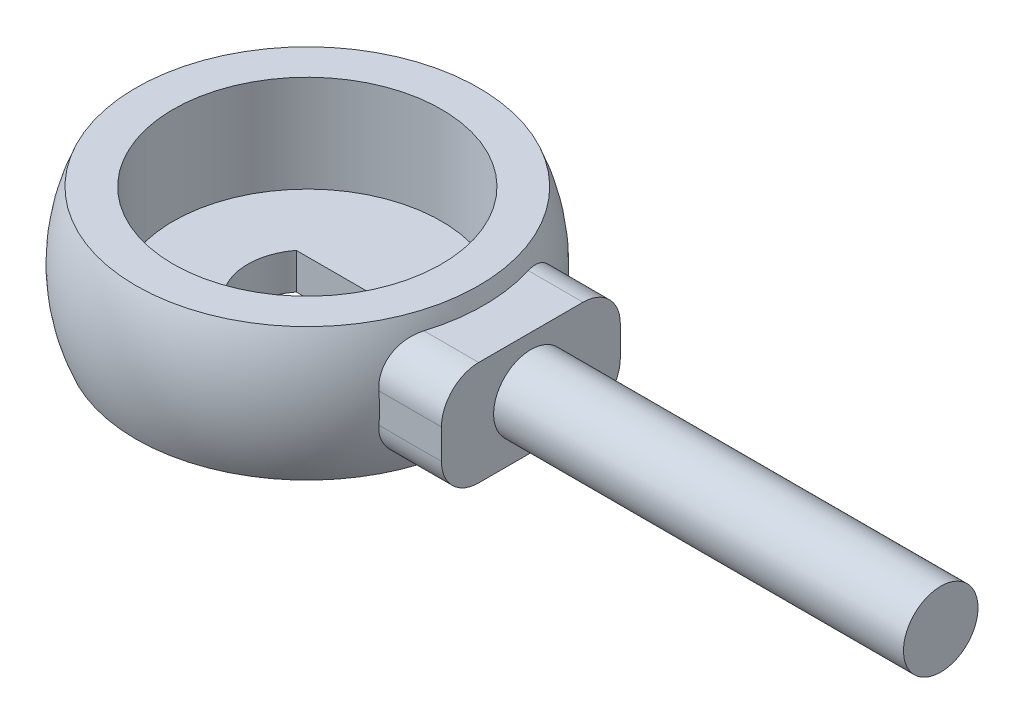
from build123d import *

# Parameters (mm, degrees)
SKETCH3_R                      = 18
CUT_EXTRUDE1_DEPTH             = 13
BOSS_EXTRUDE1_REACH            = 62.808
BOSS_EXTRUDE1_END_MAJOR_RADIUS = 1.8
BOSS_EXTRUDE1_END_MINOR_RADIUS = 23
SKETCH4_W                      = 24
SKETCH4_H                      = 14
SKETCH5_R                      = 5
BOSS_EXTRUDE2_DEPTH            = 55
CUT_EXTRUDE2_DEPTH             = 55
FILLET1_R                      = 5


with BuildPart() as part:
    # Sketch1 → Revolve1 (revolve)
    with BuildSketch(Plane.XY, mode=Mode.PRIVATE) as revolve1_sk:
        with BuildLine():
            Line((0, 8.919641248), (0, -8.919641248))
            Line((0, -8.919641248), (23, -8.919641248))
            ThreePointArc((23, -8.919641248), (24.8, 0), (23, 8.919641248))
            Line((23, 8.919641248), (0, 8.919641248))
        make_face()
    revolve(revolve1_sk.sketch.rotate(Axis((0, 8.919641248, 0), (0, -1, 0)), 90), axis=Axis((0, 8.919641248, 0), (0, -1, 0)))

    # Sketch3 → Cut-Extrude1 (cut)
    with BuildSketch(Plane(origin=(0, 8.919641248, 0), x_dir=(1, 0, 0), z_dir=(0, 1, 0))):
        with Locations(Location((0, 0, 0), (0, 0, 270))):
            Circle(SKETCH3_R)
    extrude(amount=-CUT_EXTRUDE1_DEPTH, mode=Mode.SUBTRACT)

    # Boss-Extrude1: up to this torus (the profile starts outside it)
    boss_extrude1_end = Plane(origin=(0, 0, 0), z_dir=(0, 1, 0)) * Torus(BOSS_EXTRUDE1_END_MAJOR_RADIUS, BOSS_EXTRUDE1_END_MINOR_RADIUS, mode=Mode.PRIVATE)
    # Sketch4 → Boss-Extrude1 (add, up to the surface)
    with BuildSketch(Plane(origin=(30, 0, 0), x_dir=(0, 0, -1), z_dir=(1, 0, 0)), mode=Mode.PRIVATE) as boss_extrude1_sk1:
        Rectangle(SKETCH4_W, SKETCH4_H)
    boss_extrude1_tool1 = extrude(boss_extrude1_sk1.sketch, amount=-BOSS_EXTRUDE1_REACH, mode=Mode.PRIVATE) - boss_extrude1_end
    add(boss_extrude1_tool1.solids().sort_by_distance((30, 0, 0))[0])

    # Sketch5 → Boss-Extrude2 (add)
    with BuildSketch(Plane(origin=(30, 0, 0), x_dir=(0, 0, -1), z_dir=(1, 0, 0))):
        Circle(SKETCH5_R)
    extrude(amount=BOSS_EXTRUDE2_DEPTH)

    # Sketch6 → Cut-Extrude2 (cut)
    with BuildSketch(Plane(origin=(0, -4.080358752, 0), x_dir=(1, 0, 0), z_dir=(0, 1, 0))):
        with BuildLine():
            Line((-6.35, 4.865953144), (6.35, 4.865953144))
            ThreePointArc((6.35, 4.865953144), (8, 0), (6.35, -4.865953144))
            Line((6.35, -4.865953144), (-6.35, -4.865953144))
            ThreePointArc((-6.35, -4.865953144), (-8, 0), (-6.35, 4.865953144))
        make_face()
    extrude(amount=-CUT_EXTRUDE2_DEPTH, mode=Mode.SUBTRACT)

    # Fillet1
    fillet1_edges = [part.edges().sort_by_distance(p)[0] for p in [
        (25.223894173, -7, -12),
        (25.223894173, 7, -12),
        (25.223894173, -7, 12),
        (25.223894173, 7, 12),
    ]]
    fillet(fillet1_edges, radius=FILLET1_R)


solid = part.part
